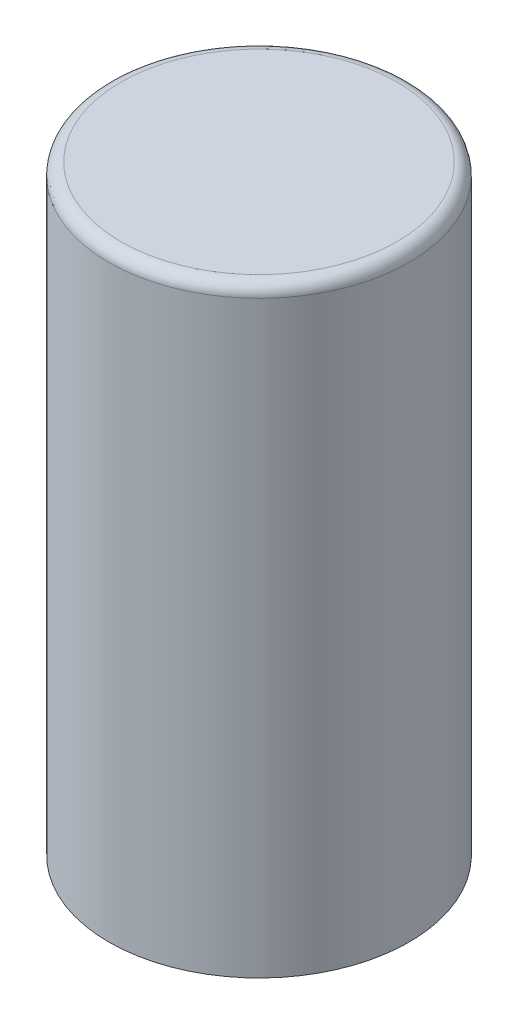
from build123d import *

# Parameters (mm, degrees)
SKETCH1_R           = 6.25
BOSS_EXTRUDE1_DEPTH = 25
FILLET1_R           = 0.5


with BuildPart() as part:
    # Sketch1 → Boss-Extrude1 (new body)
    with BuildSketch(Plane(origin=(0, 0, 0), x_dir=(1, 0, 0), z_dir=(0, 1, 0))):
        with Locations(Location((0, 0, 0), (0, 0, 270))):
            Circle(SKETCH1_R)
    extrude(amount=BOSS_EXTRUDE1_DEPTH)

    # Fillet1
    fillet1_edges = [part.edges().sort_by_distance(p)[0] for p in [
        (0, 25, -6.25),
    ]]
    fillet(fillet1_edges, radius=FILLET1_R)


solid = part.part
